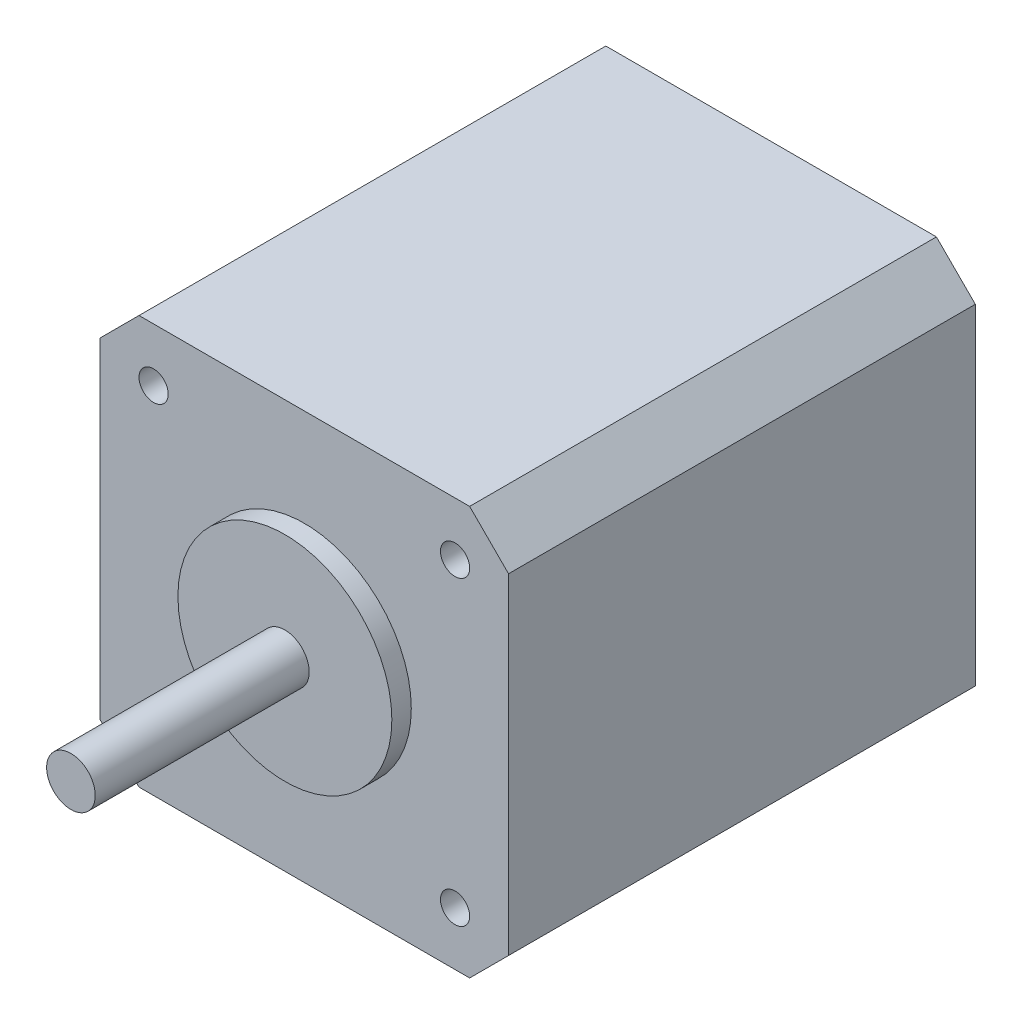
ISO-10303-21;
HEADER;
FILE_DESCRIPTION(('STEP AP214'),'2;1');
FILE_NAME('part.step','',(''),(''),'','','');
FILE_SCHEMA(('AUTOMOTIVE_DESIGN { 1 0 10303 214 1 1 1 1 }'));
ENDSEC;
DATA;
#1=APPLICATION_CONTEXT('core data for automotive mechanical design processes');
#2=APPLICATION_PROTOCOL_DEFINITION('international standard','automotive_design',2000,#1);
#3=PRODUCT_CONTEXT('',#1,'mechanical');
#4=PRODUCT('Part','Part','',(#3));
#5=PRODUCT_RELATED_PRODUCT_CATEGORY('part','',(#4));
#6=PRODUCT_DEFINITION_FORMATION('','',#4);
#7=PRODUCT_DEFINITION_CONTEXT('part definition',#1,'design');
#8=PRODUCT_DEFINITION('design','',#6,#7);
#9=PRODUCT_DEFINITION_SHAPE('','',#8);
#10=(LENGTH_UNIT() NAMED_UNIT(*) SI_UNIT(.MILLI.,.METRE.));
#11=(NAMED_UNIT(*) PLANE_ANGLE_UNIT() SI_UNIT($,.RADIAN.));
#12=(NAMED_UNIT(*) SI_UNIT($,.STERADIAN.) SOLID_ANGLE_UNIT());
#13=UNCERTAINTY_MEASURE_WITH_UNIT(LENGTH_MEASURE(1.E-05),#10,'distance_accuracy_value','');
#14=(GEOMETRIC_REPRESENTATION_CONTEXT(3) GLOBAL_UNCERTAINTY_ASSIGNED_CONTEXT((#13)) GLOBAL_UNIT_ASSIGNED_CONTEXT((#10,
#11,#12)) REPRESENTATION_CONTEXT('',''));
#15=CARTESIAN_POINT('',(0.,0.,0.));
#16=DIRECTION('',(0.,0.,1.));
#17=DIRECTION('',(1.,0.,0.));
#18=AXIS2_PLACEMENT_3D('',#15,#16,#17);
#19=CARTESIAN_POINT('',(0.,4.,48.));
#20=DIRECTION('',(1.,0.,0.));
#21=DIRECTION('',(0.,0.,-1.));
#22=AXIS2_PLACEMENT_3D('',#19,#20,#21);
#23=PLANE('',#22);
#24=DIRECTION('',(0.,-1.,0.));
#25=VECTOR('',#24,1.);
#26=CARTESIAN_POINT('',(0.,4.,0.));
#27=LINE('',#26,#25);
#28=CARTESIAN_POINT('',(0.,38.,0.));
#29=VERTEX_POINT('',#28);
#30=CARTESIAN_POINT('',(0.,4.,0.));
#31=VERTEX_POINT('',#30);
#32=EDGE_CURVE('E133',#29,#31,#27,.T.);
#33=ORIENTED_EDGE('',*,*,#32,.T.);
#34=DIRECTION('',(0.,0.,-1.));
#35=VECTOR('',#34,1.);
#36=CARTESIAN_POINT('',(0.,4.,48.));
#37=LINE('',#36,#35);
#38=CARTESIAN_POINT('',(0.,4.,48.));
#39=VERTEX_POINT('',#38);
#40=EDGE_CURVE('E44',#39,#31,#37,.T.);
#41=ORIENTED_EDGE('',*,*,#40,.F.);
#42=DIRECTION('',(0.,-1.,0.));
#43=VECTOR('',#42,1.);
#44=CARTESIAN_POINT('',(0.,4.,48.));
#45=LINE('',#44,#43);
#46=CARTESIAN_POINT('',(0.,38.,48.));
#47=VERTEX_POINT('',#46);
#48=EDGE_CURVE('E148',#47,#39,#45,.T.);
#49=ORIENTED_EDGE('',*,*,#48,.F.);
#50=DIRECTION('',(0.,0.,-1.));
#51=VECTOR('',#50,1.);
#52=CARTESIAN_POINT('',(0.,38.,48.));
#53=LINE('',#52,#51);
#54=EDGE_CURVE('E129',#47,#29,#53,.T.);
#55=ORIENTED_EDGE('',*,*,#54,.T.);
#56=EDGE_LOOP('',(#33,#41,#49,#55));
#57=FACE_BOUND('',#56,.T.);
#58=ADVANCED_FACE('F36',(#57),#23,.F.);
#59=CARTESIAN_POINT('',(0.,4.,48.));
#60=DIRECTION('',(0.707106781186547,0.707106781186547,0.));
#61=DIRECTION('',(-0.707106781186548,0.707106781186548,0.));
#62=AXIS2_PLACEMENT_3D('',#59,#60,#61);
#63=PLANE('',#62);
#64=DIRECTION('',(0.707106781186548,-0.707106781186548,0.));
#65=VECTOR('',#64,1.);
#66=CARTESIAN_POINT('',(0.,4.,0.));
#67=LINE('',#66,#65);
#68=CARTESIAN_POINT('',(4.,0.,0.));
#69=VERTEX_POINT('',#68);
#70=EDGE_CURVE('E136',#31,#69,#67,.T.);
#71=ORIENTED_EDGE('',*,*,#70,.T.);
#72=DIRECTION('',(0.,0.,-1.));
#73=VECTOR('',#72,1.);
#74=CARTESIAN_POINT('',(4.,0.,48.));
#75=LINE('',#74,#73);
#76=CARTESIAN_POINT('',(4.,0.,48.));
#77=VERTEX_POINT('',#76);
#78=EDGE_CURVE('E158',#77,#69,#75,.T.);
#79=ORIENTED_EDGE('',*,*,#78,.F.);
#80=DIRECTION('',(0.707106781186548,-0.707106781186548,0.));
#81=VECTOR('',#80,1.);
#82=CARTESIAN_POINT('',(0.,4.,48.));
#83=LINE('',#82,#81);
#84=EDGE_CURVE('E96',#39,#77,#83,.T.);
#85=ORIENTED_EDGE('',*,*,#84,.F.);
#86=ORIENTED_EDGE('',*,*,#40,.T.);
#87=EDGE_LOOP('',(#71,#79,#85,#86));
#88=FACE_BOUND('',#87,.T.);
#89=ADVANCED_FACE('F161',(#88),#63,.F.);
#90=CARTESIAN_POINT('',(4.,0.,48.));
#91=DIRECTION('',(0.,1.,0.));
#92=DIRECTION('',(0.,0.,1.));
#93=AXIS2_PLACEMENT_3D('',#90,#91,#92);
#94=PLANE('',#93);
#95=DIRECTION('',(1.,0.,0.));
#96=VECTOR('',#95,1.);
#97=CARTESIAN_POINT('',(4.,0.,0.));
#98=LINE('',#97,#96);
#99=CARTESIAN_POINT('',(38.,0.,0.));
#100=VERTEX_POINT('',#99);
#101=EDGE_CURVE('E139',#69,#100,#98,.T.);
#102=ORIENTED_EDGE('',*,*,#101,.T.);
#103=DIRECTION('',(0.,0.,-1.));
#104=VECTOR('',#103,1.);
#105=CARTESIAN_POINT('',(38.,0.,48.));
#106=LINE('',#105,#104);
#107=CARTESIAN_POINT('',(38.,0.,48.));
#108=VERTEX_POINT('',#107);
#109=EDGE_CURVE('E155',#108,#100,#106,.T.);
#110=ORIENTED_EDGE('',*,*,#109,.F.);
#111=DIRECTION('',(1.,0.,0.));
#112=VECTOR('',#111,1.);
#113=CARTESIAN_POINT('',(4.,0.,48.));
#114=LINE('',#113,#112);
#115=EDGE_CURVE('E179',#77,#108,#114,.T.);
#116=ORIENTED_EDGE('',*,*,#115,.F.);
#117=ORIENTED_EDGE('',*,*,#78,.T.);
#118=EDGE_LOOP('',(#102,#110,#116,#117));
#119=FACE_BOUND('',#118,.T.);
#120=ADVANCED_FACE('F172',(#119),#94,.F.);
#121=CARTESIAN_POINT('',(38.,0.,48.));
#122=DIRECTION('',(-0.707106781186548,0.707106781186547,0.));
#123=DIRECTION('',(-0.707106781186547,-0.707106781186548,0.));
#124=AXIS2_PLACEMENT_3D('',#121,#122,#123);
#125=PLANE('',#124);
#126=DIRECTION('',(0.707106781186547,0.707106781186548,0.));
#127=VECTOR('',#126,1.);
#128=CARTESIAN_POINT('',(38.,0.,0.));
#129=LINE('',#128,#127);
#130=CARTESIAN_POINT('',(42.,4.,0.));
#131=VERTEX_POINT('',#130);
#132=EDGE_CURVE('E141',#100,#131,#129,.T.);
#133=ORIENTED_EDGE('',*,*,#132,.T.);
#134=DIRECTION('',(0.,0.,-1.));
#135=VECTOR('',#134,1.);
#136=CARTESIAN_POINT('',(42.,4.,48.));
#137=LINE('',#136,#135);
#138=CARTESIAN_POINT('',(42.,4.,48.));
#139=VERTEX_POINT('',#138);
#140=EDGE_CURVE('E152',#139,#131,#137,.T.);
#141=ORIENTED_EDGE('',*,*,#140,.F.);
#142=DIRECTION('',(0.707106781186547,0.707106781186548,0.));
#143=VECTOR('',#142,1.);
#144=CARTESIAN_POINT('',(38.,0.,48.));
#145=LINE('',#144,#143);
#146=EDGE_CURVE('E178',#108,#139,#145,.T.);
#147=ORIENTED_EDGE('',*,*,#146,.F.);
#148=ORIENTED_EDGE('',*,*,#109,.T.);
#149=EDGE_LOOP('',(#133,#141,#147,#148));
#150=FACE_BOUND('',#149,.T.);
#151=ADVANCED_FACE('F176',(#150),#125,.F.);
#152=CARTESIAN_POINT('',(42.,4.,48.));
#153=DIRECTION('',(-1.,0.,0.));
#154=DIRECTION('',(0.,0.,1.));
#155=AXIS2_PLACEMENT_3D('',#152,#153,#154);
#156=PLANE('',#155);
#157=DIRECTION('',(0.,1.,0.));
#158=VECTOR('',#157,1.);
#159=CARTESIAN_POINT('',(42.,4.,0.));
#160=LINE('',#159,#158);
#161=CARTESIAN_POINT('',(42.,38.,0.));
#162=VERTEX_POINT('',#161);
#163=EDGE_CURVE('E143',#131,#162,#160,.T.);
#164=ORIENTED_EDGE('',*,*,#163,.T.);
#165=DIRECTION('',(0.,0.,-1.));
#166=VECTOR('',#165,1.);
#167=CARTESIAN_POINT('',(42.,38.,48.));
#168=LINE('',#167,#166);
#169=CARTESIAN_POINT('',(42.,38.,48.));
#170=VERTEX_POINT('',#169);
#171=EDGE_CURVE('E124',#170,#162,#168,.T.);
#172=ORIENTED_EDGE('',*,*,#171,.F.);
#173=DIRECTION('',(0.,1.,0.));
#174=VECTOR('',#173,1.);
#175=CARTESIAN_POINT('',(42.,4.,48.));
#176=LINE('',#175,#174);
#177=EDGE_CURVE('E115',#139,#170,#176,.T.);
#178=ORIENTED_EDGE('',*,*,#177,.F.);
#179=ORIENTED_EDGE('',*,*,#140,.T.);
#180=EDGE_LOOP('',(#164,#172,#178,#179));
#181=FACE_BOUND('',#180,.T.);
#182=ADVANCED_FACE('F264',(#181),#156,.F.);
#183=CARTESIAN_POINT('',(38.,42.,48.));
#184=DIRECTION('',(-0.707106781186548,-0.707106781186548,0.));
#185=DIRECTION('',(0.707106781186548,-0.707106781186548,0.));
#186=AXIS2_PLACEMENT_3D('',#183,#184,#185);
#187=PLANE('',#186);
#188=DIRECTION('',(-0.707106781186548,0.707106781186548,0.));
#189=VECTOR('',#188,1.);
#190=CARTESIAN_POINT('',(38.,42.,0.));
#191=LINE('',#190,#189);
#192=CARTESIAN_POINT('',(38.,42.,0.));
#193=VERTEX_POINT('',#192);
#194=EDGE_CURVE('E123',#162,#193,#191,.T.);
#195=ORIENTED_EDGE('',*,*,#194,.T.);
#196=DIRECTION('',(0.,0.,-1.));
#197=VECTOR('',#196,1.);
#198=CARTESIAN_POINT('',(38.,42.,48.));
#199=LINE('',#198,#197);
#200=CARTESIAN_POINT('',(38.,42.,48.));
#201=VERTEX_POINT('',#200);
#202=EDGE_CURVE('E120',#201,#193,#199,.T.);
#203=ORIENTED_EDGE('',*,*,#202,.F.);
#204=DIRECTION('',(-0.707106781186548,0.707106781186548,0.));
#205=VECTOR('',#204,1.);
#206=CARTESIAN_POINT('',(38.,42.,48.));
#207=LINE('',#206,#205);
#208=EDGE_CURVE('E109',#170,#201,#207,.T.);
#209=ORIENTED_EDGE('',*,*,#208,.F.);
#210=ORIENTED_EDGE('',*,*,#171,.T.);
#211=EDGE_LOOP('',(#195,#203,#209,#210));
#212=FACE_BOUND('',#211,.T.);
#213=ADVANCED_FACE('F121',(#212),#187,.F.);
#214=CARTESIAN_POINT('',(4.,42.,48.));
#215=DIRECTION('',(0.,-1.,0.));
#216=DIRECTION('',(0.,0.,-1.));
#217=AXIS2_PLACEMENT_3D('',#214,#215,#216);
#218=PLANE('',#217);
#219=DIRECTION('',(-1.,0.,0.));
#220=VECTOR('',#219,1.);
#221=CARTESIAN_POINT('',(4.,42.,0.));
#222=LINE('',#221,#220);
#223=CARTESIAN_POINT('',(4.,42.,0.));
#224=VERTEX_POINT('',#223);
#225=EDGE_CURVE('E81',#193,#224,#222,.T.);
#226=ORIENTED_EDGE('',*,*,#225,.T.);
#227=DIRECTION('',(0.,0.,-1.));
#228=VECTOR('',#227,1.);
#229=CARTESIAN_POINT('',(4.,42.,48.));
#230=LINE('',#229,#228);
#231=CARTESIAN_POINT('',(4.,42.,48.));
#232=VERTEX_POINT('',#231);
#233=EDGE_CURVE('E125',#232,#224,#230,.T.);
#234=ORIENTED_EDGE('',*,*,#233,.F.);
#235=DIRECTION('',(-1.,0.,0.));
#236=VECTOR('',#235,1.);
#237=CARTESIAN_POINT('',(4.,42.,48.));
#238=LINE('',#237,#236);
#239=EDGE_CURVE('E113',#201,#232,#238,.T.);
#240=ORIENTED_EDGE('',*,*,#239,.F.);
#241=ORIENTED_EDGE('',*,*,#202,.T.);
#242=EDGE_LOOP('',(#226,#234,#240,#241));
#243=FACE_BOUND('',#242,.T.);
#244=ADVANCED_FACE('F127',(#243),#218,.F.);
#245=CARTESIAN_POINT('',(0.,38.,48.));
#246=DIRECTION('',(0.707106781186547,-0.707106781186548,0.));
#247=DIRECTION('',(0.707106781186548,0.707106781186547,0.));
#248=AXIS2_PLACEMENT_3D('',#245,#246,#247);
#249=PLANE('',#248);
#250=DIRECTION('',(-0.707106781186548,-0.707106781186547,0.));
#251=VECTOR('',#250,1.);
#252=CARTESIAN_POINT('',(0.,38.,0.));
#253=LINE('',#252,#251);
#254=EDGE_CURVE('E87',#224,#29,#253,.T.);
#255=ORIENTED_EDGE('',*,*,#254,.T.);
#256=ORIENTED_EDGE('',*,*,#54,.F.);
#257=DIRECTION('',(-0.707106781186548,-0.707106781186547,0.));
#258=VECTOR('',#257,1.);
#259=CARTESIAN_POINT('',(0.,38.,48.));
#260=LINE('',#259,#258);
#261=EDGE_CURVE('E52',#232,#47,#260,.T.);
#262=ORIENTED_EDGE('',*,*,#261,.F.);
#263=ORIENTED_EDGE('',*,*,#233,.T.);
#264=EDGE_LOOP('',(#255,#256,#262,#263));
#265=FACE_BOUND('',#264,.T.);
#266=ADVANCED_FACE('F229',(#265),#249,.F.);
#267=CARTESIAN_POINT('',(0.,0.,48.));
#268=DIRECTION('',(0.,0.,-1.));
#269=DIRECTION('',(-1.,0.,0.));
#270=AXIS2_PLACEMENT_3D('',#267,#268,#269);
#271=PLANE('',#270);
#272=CARTESIAN_POINT('',(36.5,5.5,48.));
#273=DIRECTION('',(0.,0.,1.));
#274=DIRECTION('',(1.,0.,0.));
#275=AXIS2_PLACEMENT_3D('',#272,#273,#274);
#276=CIRCLE('',#275,1.5);
#277=CARTESIAN_POINT('',(38.,5.5,48.));
#278=VERTEX_POINT('',#277);
#279=EDGE_CURVE('E212',#278,#278,#276,.T.);
#280=ORIENTED_EDGE('',*,*,#279,.F.);
#281=EDGE_LOOP('',(#280));
#282=FACE_BOUND('',#281,.T.);
#283=CARTESIAN_POINT('',(5.5,5.50000000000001,48.));
#284=DIRECTION('',(0.,0.,1.));
#285=DIRECTION('',(1.,0.,0.));
#286=AXIS2_PLACEMENT_3D('',#283,#284,#285);
#287=CIRCLE('',#286,1.5);
#288=CARTESIAN_POINT('',(7.,5.50000000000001,48.));
#289=VERTEX_POINT('',#288);
#290=EDGE_CURVE('E206',#289,#289,#287,.T.);
#291=ORIENTED_EDGE('',*,*,#290,.F.);
#292=EDGE_LOOP('',(#291));
#293=FACE_BOUND('',#292,.T.);
#294=CARTESIAN_POINT('',(36.5,36.5,48.));
#295=DIRECTION('',(0.,0.,1.));
#296=DIRECTION('',(1.,0.,0.));
#297=AXIS2_PLACEMENT_3D('',#294,#295,#296);
#298=CIRCLE('',#297,1.5);
#299=CARTESIAN_POINT('',(38.,36.5,48.));
#300=VERTEX_POINT('',#299);
#301=EDGE_CURVE('E200',#300,#300,#298,.T.);
#302=ORIENTED_EDGE('',*,*,#301,.F.);
#303=EDGE_LOOP('',(#302));
#304=FACE_BOUND('',#303,.T.);
#305=CARTESIAN_POINT('',(5.5,36.5,48.));
#306=DIRECTION('',(0.,0.,1.));
#307=DIRECTION('',(1.,0.,0.));
#308=AXIS2_PLACEMENT_3D('',#305,#306,#307);
#309=CIRCLE('',#308,1.5);
#310=CARTESIAN_POINT('',(7.,36.5,48.));
#311=VERTEX_POINT('',#310);
#312=EDGE_CURVE('E194',#311,#311,#309,.T.);
#313=ORIENTED_EDGE('',*,*,#312,.F.);
#314=EDGE_LOOP('',(#313));
#315=FACE_BOUND('',#314,.T.);
#316=CARTESIAN_POINT('',(21.,21.,48.));
#317=DIRECTION('',(0.,0.,-1.));
#318=DIRECTION('',(-1.,0.,0.));
#319=AXIS2_PLACEMENT_3D('',#316,#317,#318);
#320=CIRCLE('',#319,11.);
#321=CARTESIAN_POINT('',(10.,21.,48.));
#322=VERTEX_POINT('',#321);
#323=EDGE_CURVE('E11',#322,#322,#320,.F.);
#324=ORIENTED_EDGE('',*,*,#323,.F.);
#325=EDGE_LOOP('',(#324));
#326=FACE_BOUND('',#325,.T.);
#327=ORIENTED_EDGE('',*,*,#48,.T.);
#328=ORIENTED_EDGE('',*,*,#84,.T.);
#329=ORIENTED_EDGE('',*,*,#115,.T.);
#330=ORIENTED_EDGE('',*,*,#146,.T.);
#331=ORIENTED_EDGE('',*,*,#177,.T.);
#332=ORIENTED_EDGE('',*,*,#208,.T.);
#333=ORIENTED_EDGE('',*,*,#239,.T.);
#334=ORIENTED_EDGE('',*,*,#261,.T.);
#335=EDGE_LOOP('',(#327,#328,#329,#330,#331,#332,#333,#334));
#336=FACE_BOUND('',#335,.T.);
#337=ADVANCED_FACE('F111',(#282,#293,#304,#315,#326,#336),#271,.F.);
#338=CARTESIAN_POINT('',(0.,0.,0.));
#339=DIRECTION('',(0.,0.,-1.));
#340=DIRECTION('',(-1.,0.,0.));
#341=AXIS2_PLACEMENT_3D('',#338,#339,#340);
#342=PLANE('',#341);
#343=ORIENTED_EDGE('',*,*,#32,.F.);
#344=ORIENTED_EDGE('',*,*,#254,.F.);
#345=ORIENTED_EDGE('',*,*,#225,.F.);
#346=ORIENTED_EDGE('',*,*,#194,.F.);
#347=ORIENTED_EDGE('',*,*,#163,.F.);
#348=ORIENTED_EDGE('',*,*,#132,.F.);
#349=ORIENTED_EDGE('',*,*,#101,.F.);
#350=ORIENTED_EDGE('',*,*,#70,.F.);
#351=EDGE_LOOP('',(#343,#344,#345,#346,#347,#348,#349,#350));
#352=FACE_BOUND('',#351,.T.);
#353=ADVANCED_FACE('F166',(#352),#342,.T.);
#354=CARTESIAN_POINT('',(21.,21.,50.));
#355=DIRECTION('',(0.,0.,-1.));
#356=DIRECTION('',(-1.,0.,0.));
#357=AXIS2_PLACEMENT_3D('',#354,#355,#356);
#358=CYLINDRICAL_SURFACE('',#357,11.);
#359=CARTESIAN_POINT('',(21.,21.,50.));
#360=DIRECTION('',(0.,0.,1.));
#361=DIRECTION('',(1.,0.,0.));
#362=AXIS2_PLACEMENT_3D('',#359,#360,#361);
#363=CIRCLE('',#362,11.);
#364=CARTESIAN_POINT('',(32.,21.,50.));
#365=VERTEX_POINT('',#364);
#366=EDGE_CURVE('E137',#365,#365,#363,.T.);
#367=ORIENTED_EDGE('',*,*,#366,.F.);
#368=EDGE_LOOP('',(#367));
#369=FACE_BOUND('',#368,.T.);
#370=ORIENTED_EDGE('',*,*,#323,.T.);
#371=EDGE_LOOP('',(#370));
#372=FACE_BOUND('',#371,.T.);
#373=ADVANCED_FACE('F239',(#369,#372),#358,.T.);
#374=CARTESIAN_POINT('',(21.,21.,50.));
#375=DIRECTION('',(0.,0.,1.));
#376=DIRECTION('',(1.,0.,0.));
#377=AXIS2_PLACEMENT_3D('',#374,#375,#376);
#378=PLANE('',#377);
#379=CARTESIAN_POINT('',(21.,21.,50.));
#380=DIRECTION('',(0.,0.,1.));
#381=DIRECTION('',(1.,0.,0.));
#382=AXIS2_PLACEMENT_3D('',#379,#380,#381);
#383=CIRCLE('',#382,2.5);
#384=CARTESIAN_POINT('',(23.5,21.,50.));
#385=VERTEX_POINT('',#384);
#386=EDGE_CURVE('E188',#385,#385,#383,.T.);
#387=ORIENTED_EDGE('',*,*,#386,.F.);
#388=EDGE_LOOP('',(#387));
#389=FACE_BOUND('',#388,.T.);
#390=ORIENTED_EDGE('',*,*,#366,.T.);
#391=EDGE_LOOP('',(#390));
#392=FACE_BOUND('',#391,.T.);
#393=ADVANCED_FACE('F241',(#389,#392),#378,.T.);
#394=CARTESIAN_POINT('',(21.,21.,72.));
#395=DIRECTION('',(0.,0.,-1.));
#396=DIRECTION('',(-1.,0.,0.));
#397=AXIS2_PLACEMENT_3D('',#394,#395,#396);
#398=CYLINDRICAL_SURFACE('',#397,2.5);
#399=CARTESIAN_POINT('',(21.,21.,72.));
#400=DIRECTION('',(0.,0.,1.));
#401=DIRECTION('',(1.,0.,0.));
#402=AXIS2_PLACEMENT_3D('',#399,#400,#401);
#403=CIRCLE('',#402,2.5);
#404=CARTESIAN_POINT('',(23.5,21.,72.));
#405=VERTEX_POINT('',#404);
#406=EDGE_CURVE('E187',#405,#405,#403,.T.);
#407=ORIENTED_EDGE('',*,*,#406,.F.);
#408=EDGE_LOOP('',(#407));
#409=FACE_BOUND('',#408,.T.);
#410=ORIENTED_EDGE('',*,*,#386,.T.);
#411=EDGE_LOOP('',(#410));
#412=FACE_BOUND('',#411,.T.);
#413=ADVANCED_FACE('F248',(#409,#412),#398,.T.);
#414=CARTESIAN_POINT('',(21.,21.,72.));
#415=DIRECTION('',(0.,0.,1.));
#416=DIRECTION('',(1.,0.,0.));
#417=AXIS2_PLACEMENT_3D('',#414,#415,#416);
#418=PLANE('',#417);
#419=ORIENTED_EDGE('',*,*,#406,.T.);
#420=EDGE_LOOP('',(#419));
#421=FACE_BOUND('',#420,.T.);
#422=ADVANCED_FACE('F308',(#421),#418,.T.);
#423=CARTESIAN_POINT('',(5.5,36.5,43.5));
#424=DIRECTION('',(0.,0.,1.));
#425=DIRECTION('',(1.,0.,0.));
#426=AXIS2_PLACEMENT_3D('',#423,#424,#425);
#427=CYLINDRICAL_SURFACE('',#426,1.5);
#428=CARTESIAN_POINT('',(5.5,36.5,43.5));
#429=DIRECTION('',(0.,0.,1.));
#430=DIRECTION('',(1.,0.,0.));
#431=AXIS2_PLACEMENT_3D('',#428,#429,#430);
#432=CIRCLE('',#431,1.5);
#433=CARTESIAN_POINT('',(7.,36.5,43.5));
#434=VERTEX_POINT('',#433);
#435=EDGE_CURVE('E191',#434,#434,#432,.T.);
#436=ORIENTED_EDGE('',*,*,#435,.F.);
#437=EDGE_LOOP('',(#436));
#438=FACE_BOUND('',#437,.T.);
#439=ORIENTED_EDGE('',*,*,#312,.T.);
#440=EDGE_LOOP('',(#439));
#441=FACE_BOUND('',#440,.T.);
#442=ADVANCED_FACE('F315',(#438,#441),#427,.F.);
#443=CARTESIAN_POINT('',(5.5,36.5,43.5));
#444=DIRECTION('',(0.,0.,1.));
#445=DIRECTION('',(1.,0.,0.));
#446=AXIS2_PLACEMENT_3D('',#443,#444,#445);
#447=PLANE('',#446);
#448=ORIENTED_EDGE('',*,*,#435,.T.);
#449=EDGE_LOOP('',(#448));
#450=FACE_BOUND('',#449,.T.);
#451=ADVANCED_FACE('F323',(#450),#447,.T.);
#452=CARTESIAN_POINT('',(36.5,36.5,43.5));
#453=DIRECTION('',(0.,0.,1.));
#454=DIRECTION('',(1.,0.,0.));
#455=AXIS2_PLACEMENT_3D('',#452,#453,#454);
#456=CYLINDRICAL_SURFACE('',#455,1.5);
#457=CARTESIAN_POINT('',(36.5,36.5,43.5));
#458=DIRECTION('',(0.,0.,1.));
#459=DIRECTION('',(1.,0.,0.));
#460=AXIS2_PLACEMENT_3D('',#457,#458,#459);
#461=CIRCLE('',#460,1.5);
#462=CARTESIAN_POINT('',(38.,36.5,43.5));
#463=VERTEX_POINT('',#462);
#464=EDGE_CURVE('E197',#463,#463,#461,.T.);
#465=ORIENTED_EDGE('',*,*,#464,.F.);
#466=EDGE_LOOP('',(#465));
#467=FACE_BOUND('',#466,.T.);
#468=ORIENTED_EDGE('',*,*,#301,.T.);
#469=EDGE_LOOP('',(#468));
#470=FACE_BOUND('',#469,.T.);
#471=ADVANCED_FACE('F331',(#467,#470),#456,.F.);
#472=CARTESIAN_POINT('',(36.5,36.5,43.5));
#473=DIRECTION('',(0.,0.,1.));
#474=DIRECTION('',(1.,0.,0.));
#475=AXIS2_PLACEMENT_3D('',#472,#473,#474);
#476=PLANE('',#475);
#477=ORIENTED_EDGE('',*,*,#464,.T.);
#478=EDGE_LOOP('',(#477));
#479=FACE_BOUND('',#478,.T.);
#480=ADVANCED_FACE('F339',(#479),#476,.T.);
#481=CARTESIAN_POINT('',(5.5,5.50000000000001,43.5));
#482=DIRECTION('',(0.,0.,1.));
#483=DIRECTION('',(1.,0.,0.));
#484=AXIS2_PLACEMENT_3D('',#481,#482,#483);
#485=CYLINDRICAL_SURFACE('',#484,1.5);
#486=CARTESIAN_POINT('',(5.5,5.50000000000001,43.5));
#487=DIRECTION('',(0.,0.,1.));
#488=DIRECTION('',(1.,0.,0.));
#489=AXIS2_PLACEMENT_3D('',#486,#487,#488);
#490=CIRCLE('',#489,1.5);
#491=CARTESIAN_POINT('',(7.,5.50000000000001,43.5));
#492=VERTEX_POINT('',#491);
#493=EDGE_CURVE('E203',#492,#492,#490,.T.);
#494=ORIENTED_EDGE('',*,*,#493,.F.);
#495=EDGE_LOOP('',(#494));
#496=FACE_BOUND('',#495,.T.);
#497=ORIENTED_EDGE('',*,*,#290,.T.);
#498=EDGE_LOOP('',(#497));
#499=FACE_BOUND('',#498,.T.);
#500=ADVANCED_FACE('F347',(#496,#499),#485,.F.);
#501=CARTESIAN_POINT('',(5.5,5.50000000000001,43.5));
#502=DIRECTION('',(0.,0.,1.));
#503=DIRECTION('',(1.,0.,0.));
#504=AXIS2_PLACEMENT_3D('',#501,#502,#503);
#505=PLANE('',#504);
#506=ORIENTED_EDGE('',*,*,#493,.T.);
#507=EDGE_LOOP('',(#506));
#508=FACE_BOUND('',#507,.T.);
#509=ADVANCED_FACE('F223',(#508),#505,.T.);
#510=CARTESIAN_POINT('',(36.5,5.5,43.5));
#511=DIRECTION('',(0.,0.,1.));
#512=DIRECTION('',(1.,0.,0.));
#513=AXIS2_PLACEMENT_3D('',#510,#511,#512);
#514=CYLINDRICAL_SURFACE('',#513,1.5);
#515=CARTESIAN_POINT('',(36.5,5.5,43.5));
#516=DIRECTION('',(0.,0.,1.));
#517=DIRECTION('',(1.,0.,0.));
#518=AXIS2_PLACEMENT_3D('',#515,#516,#517);
#519=CIRCLE('',#518,1.5);
#520=CARTESIAN_POINT('',(38.,5.5,43.5));
#521=VERTEX_POINT('',#520);
#522=EDGE_CURVE('E209',#521,#521,#519,.T.);
#523=ORIENTED_EDGE('',*,*,#522,.F.);
#524=EDGE_LOOP('',(#523));
#525=FACE_BOUND('',#524,.T.);
#526=ORIENTED_EDGE('',*,*,#279,.T.);
#527=EDGE_LOOP('',(#526));
#528=FACE_BOUND('',#527,.T.);
#529=ADVANCED_FACE('F220',(#525,#528),#514,.F.);
#530=CARTESIAN_POINT('',(36.5,5.5,43.5));
#531=DIRECTION('',(0.,0.,1.));
#532=DIRECTION('',(1.,0.,0.));
#533=AXIS2_PLACEMENT_3D('',#530,#531,#532);
#534=PLANE('',#533);
#535=ORIENTED_EDGE('',*,*,#522,.T.);
#536=EDGE_LOOP('',(#535));
#537=FACE_BOUND('',#536,.T.);
#538=ADVANCED_FACE('F218',(#537),#534,.T.);
#539=CLOSED_SHELL('',(#58,#89,#120,#151,#182,#213,#244,#266,#337,#353,#373,#393,#413,#422,#442,
#451,#471,#480,#500,#509,#529,#538));
#540=MANIFOLD_SOLID_BREP('B2',#539);
#541=ADVANCED_BREP_SHAPE_REPRESENTATION('',(#18,#540),#14);
#542=SHAPE_DEFINITION_REPRESENTATION(#9,#541);
ENDSEC;
END-ISO-10303-21;
